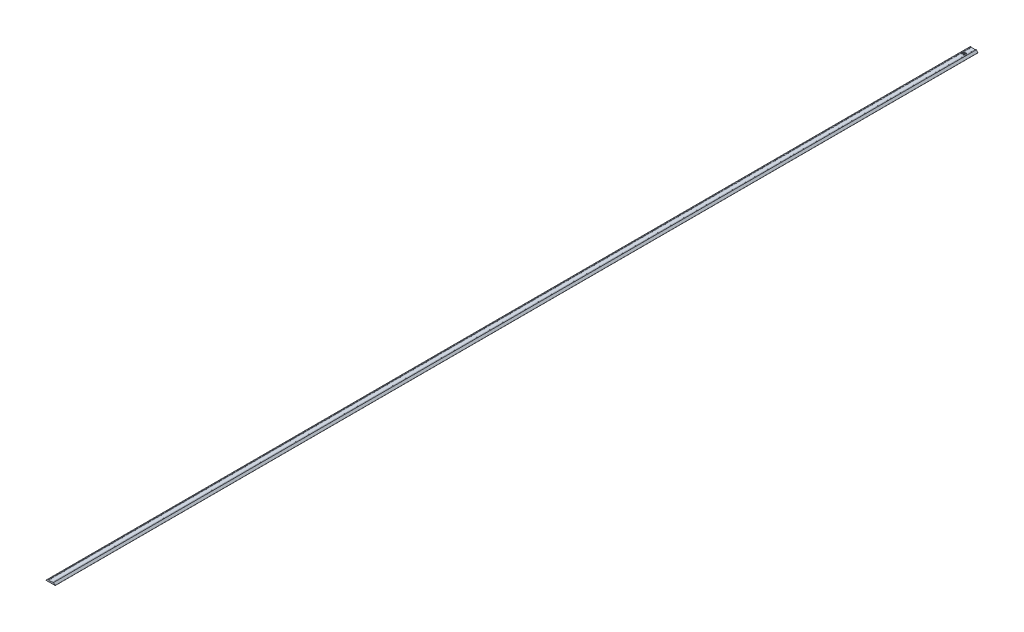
ISO-10303-21;
HEADER;
FILE_DESCRIPTION(('STEP AP214'),'2;1');
FILE_NAME('part.step','',(''),(''),'','','');
FILE_SCHEMA(('AUTOMOTIVE_DESIGN { 1 0 10303 214 1 1 1 1 }'));
ENDSEC;
DATA;
#1=APPLICATION_CONTEXT('core data for automotive mechanical design processes');
#2=APPLICATION_PROTOCOL_DEFINITION('international standard','automotive_design',2000,#1);
#3=PRODUCT_CONTEXT('',#1,'mechanical');
#4=PRODUCT('Part','Part','',(#3));
#5=PRODUCT_RELATED_PRODUCT_CATEGORY('part','',(#4));
#6=PRODUCT_DEFINITION_FORMATION('','',#4);
#7=PRODUCT_DEFINITION_CONTEXT('part definition',#1,'design');
#8=PRODUCT_DEFINITION('design','',#6,#7);
#9=PRODUCT_DEFINITION_SHAPE('','',#8);
#10=(LENGTH_UNIT() NAMED_UNIT(*) SI_UNIT(.MILLI.,.METRE.));
#11=(NAMED_UNIT(*) PLANE_ANGLE_UNIT() SI_UNIT($,.RADIAN.));
#12=(NAMED_UNIT(*) SI_UNIT($,.STERADIAN.) SOLID_ANGLE_UNIT());
#13=UNCERTAINTY_MEASURE_WITH_UNIT(LENGTH_MEASURE(1.E-05),#10,'distance_accuracy_value','');
#14=(GEOMETRIC_REPRESENTATION_CONTEXT(3) GLOBAL_UNCERTAINTY_ASSIGNED_CONTEXT((#13)) GLOBAL_UNIT_ASSIGNED_CONTEXT((#10,
#11,#12)) REPRESENTATION_CONTEXT('',''));
#15=CARTESIAN_POINT('',(0.,0.,0.));
#16=DIRECTION('',(0.,0.,1.));
#17=DIRECTION('',(1.,0.,0.));
#18=AXIS2_PLACEMENT_3D('',#15,#16,#17);
#19=CARTESIAN_POINT('',(3.,0.0499999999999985,2000.));
#20=DIRECTION('',(-1.,0.,0.));
#21=DIRECTION('',(0.,-1.,0.));
#22=AXIS2_PLACEMENT_3D('',#19,#20,#21);
#23=PLANE('',#22);
#24=DIRECTION('',(0.,1.,0.));
#25=VECTOR('',#24,1.);
#26=CARTESIAN_POINT('',(3.,0.0499999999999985,0.));
#27=LINE('',#26,#25);
#28=CARTESIAN_POINT('',(3.,0.,0.));
#29=VERTEX_POINT('',#28);
#30=CARTESIAN_POINT('',(3.,0.0499999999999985,0.));
#31=VERTEX_POINT('',#30);
#32=EDGE_CURVE('E300',#29,#31,#27,.T.);
#33=ORIENTED_EDGE('',*,*,#32,.T.);
#34=DIRECTION('',(0.,0.,-1.));
#35=VECTOR('',#34,1.);
#36=CARTESIAN_POINT('',(3.,0.0499999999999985,2000.));
#37=LINE('',#36,#35);
#38=CARTESIAN_POINT('',(3.,0.0499999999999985,2000.));
#39=VERTEX_POINT('',#38);
#40=EDGE_CURVE('E11',#39,#31,#37,.T.);
#41=ORIENTED_EDGE('',*,*,#40,.F.);
#42=DIRECTION('',(0.,1.,0.));
#43=VECTOR('',#42,1.);
#44=CARTESIAN_POINT('',(3.,0.0499999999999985,2000.));
#45=LINE('',#44,#43);
#46=CARTESIAN_POINT('',(3.,0.,2000.));
#47=VERTEX_POINT('',#46);
#48=EDGE_CURVE('E371',#47,#39,#45,.T.);
#49=ORIENTED_EDGE('',*,*,#48,.F.);
#50=DIRECTION('',(0.,0.,-1.));
#51=VECTOR('',#50,1.);
#52=CARTESIAN_POINT('',(3.,0.,2000.));
#53=LINE('',#52,#51);
#54=EDGE_CURVE('E296',#47,#29,#53,.T.);
#55=ORIENTED_EDGE('',*,*,#54,.T.);
#56=EDGE_LOOP('',(#33,#41,#49,#55));
#57=FACE_BOUND('',#56,.T.);
#58=ADVANCED_FACE('F35',(#57),#23,.F.);
#59=CARTESIAN_POINT('',(17.,0.0500000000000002,2000.));
#60=DIRECTION('',(0.,1.,0.));
#61=DIRECTION('',(-1.,0.,0.));
#62=AXIS2_PLACEMENT_3D('',#59,#60,#61);
#63=PLANE('',#62);
#64=CARTESIAN_POINT('',(10.,0.0499999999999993,20.));
#65=DIRECTION('',(0.,1.,0.));
#66=DIRECTION('',(-1.,0.,0.));
#67=AXIS2_PLACEMENT_3D('',#64,#65,#66);
#68=CIRCLE('',#67,1.7);
#69=CARTESIAN_POINT('',(8.30000000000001,0.0499999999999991,20.));
#70=VERTEX_POINT('',#69);
#71=EDGE_CURVE('E38',#70,#70,#68,.T.);
#72=ORIENTED_EDGE('',*,*,#71,.T.);
#73=EDGE_LOOP('',(#72));
#74=FACE_BOUND('',#73,.T.);
#75=DIRECTION('',(1.,0.,0.));
#76=VECTOR('',#75,1.);
#77=CARTESIAN_POINT('',(17.,0.0500000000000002,0.));
#78=LINE('',#77,#76);
#79=CARTESIAN_POINT('',(17.,0.0500000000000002,0.));
#80=VERTEX_POINT('',#79);
#81=EDGE_CURVE('E303',#31,#80,#78,.T.);
#82=ORIENTED_EDGE('',*,*,#81,.T.);
#83=DIRECTION('',(0.,0.,-1.));
#84=VECTOR('',#83,1.);
#85=CARTESIAN_POINT('',(17.,0.0500000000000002,2000.));
#86=LINE('',#85,#84);
#87=CARTESIAN_POINT('',(17.,0.0500000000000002,2000.));
#88=VERTEX_POINT('',#87);
#89=EDGE_CURVE('E44',#88,#80,#86,.T.);
#90=ORIENTED_EDGE('',*,*,#89,.F.);
#91=DIRECTION('',(1.,0.,0.));
#92=VECTOR('',#91,1.);
#93=CARTESIAN_POINT('',(17.,0.0500000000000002,2000.));
#94=LINE('',#93,#92);
#95=EDGE_CURVE('E179',#39,#88,#94,.T.);
#96=ORIENTED_EDGE('',*,*,#95,.F.);
#97=ORIENTED_EDGE('',*,*,#40,.T.);
#98=EDGE_LOOP('',(#82,#90,#96,#97));
#99=FACE_BOUND('',#98,.T.);
#100=ADVANCED_FACE('F570',(#74,#99),#63,.F.);
#101=CARTESIAN_POINT('',(17.,0.,2000.));
#102=DIRECTION('',(1.,0.,0.));
#103=DIRECTION('',(0.,0.,-1.));
#104=AXIS2_PLACEMENT_3D('',#101,#102,#103);
#105=PLANE('',#104);
#106=DIRECTION('',(0.,-1.,0.));
#107=VECTOR('',#106,1.);
#108=CARTESIAN_POINT('',(17.,0.,0.));
#109=LINE('',#108,#107);
#110=CARTESIAN_POINT('',(17.,0.,0.));
#111=VERTEX_POINT('',#110);
#112=EDGE_CURVE('E305',#80,#111,#109,.T.);
#113=ORIENTED_EDGE('',*,*,#112,.T.);
#114=DIRECTION('',(0.,0.,-1.));
#115=VECTOR('',#114,1.);
#116=CARTESIAN_POINT('',(17.,0.,2000.));
#117=LINE('',#116,#115);
#118=CARTESIAN_POINT('',(17.,0.,2000.));
#119=VERTEX_POINT('',#118);
#120=EDGE_CURVE('E462',#119,#111,#117,.T.);
#121=ORIENTED_EDGE('',*,*,#120,.F.);
#122=DIRECTION('',(0.,-1.,0.));
#123=VECTOR('',#122,1.);
#124=CARTESIAN_POINT('',(17.,0.,2000.));
#125=LINE('',#124,#123);
#126=EDGE_CURVE('E471',#88,#119,#125,.T.);
#127=ORIENTED_EDGE('',*,*,#126,.F.);
#128=ORIENTED_EDGE('',*,*,#89,.T.);
#129=EDGE_LOOP('',(#113,#121,#127,#128));
#130=FACE_BOUND('',#129,.T.);
#131=ADVANCED_FACE('F469',(#130),#105,.F.);
#132=CARTESIAN_POINT('',(19.9,0.,2000.));
#133=DIRECTION('',(0.,1.,0.));
#134=DIRECTION('',(-1.,0.,0.));
#135=AXIS2_PLACEMENT_3D('',#132,#133,#134);
#136=PLANE('',#135);
#137=DIRECTION('',(1.,0.,0.));
#138=VECTOR('',#137,1.);
#139=CARTESIAN_POINT('',(19.9,0.,0.));
#140=LINE('',#139,#138);
#141=CARTESIAN_POINT('',(19.9,0.,0.));
#142=VERTEX_POINT('',#141);
#143=EDGE_CURVE('E307',#111,#142,#140,.T.);
#144=ORIENTED_EDGE('',*,*,#143,.T.);
#145=DIRECTION('',(0.,0.,-1.));
#146=VECTOR('',#145,1.);
#147=CARTESIAN_POINT('',(19.9,0.,2000.));
#148=LINE('',#147,#146);
#149=CARTESIAN_POINT('',(19.9,0.,2000.));
#150=VERTEX_POINT('',#149);
#151=EDGE_CURVE('E459',#150,#142,#148,.T.);
#152=ORIENTED_EDGE('',*,*,#151,.F.);
#153=DIRECTION('',(1.,0.,0.));
#154=VECTOR('',#153,1.);
#155=CARTESIAN_POINT('',(19.9,0.,2000.));
#156=LINE('',#155,#154);
#157=EDGE_CURVE('E489',#119,#150,#156,.T.);
#158=ORIENTED_EDGE('',*,*,#157,.F.);
#159=ORIENTED_EDGE('',*,*,#120,.T.);
#160=EDGE_LOOP('',(#144,#152,#158,#159));
#161=FACE_BOUND('',#160,.T.);
#162=ADVANCED_FACE('F480',(#161),#136,.F.);
#163=CARTESIAN_POINT('',(19.9,0.1,2000.));
#164=DIRECTION('',(0.,0.,-1.));
#165=DIRECTION('',(-1.,0.,0.));
#166=AXIS2_PLACEMENT_3D('',#163,#164,#165);
#167=CYLINDRICAL_SURFACE('',#166,0.0999999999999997);
#168=CARTESIAN_POINT('',(19.9,0.1,0.));
#169=DIRECTION('',(0.,0.,1.));
#170=DIRECTION('',(-1.,0.,0.));
#171=AXIS2_PLACEMENT_3D('',#168,#169,#170);
#172=CIRCLE('',#171,0.0999999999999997);
#173=CARTESIAN_POINT('',(20.,0.1,0.));
#174=VERTEX_POINT('',#173);
#175=EDGE_CURVE('E309',#142,#174,#172,.T.);
#176=ORIENTED_EDGE('',*,*,#175,.T.);
#177=DIRECTION('',(0.,0.,-1.));
#178=VECTOR('',#177,1.);
#179=CARTESIAN_POINT('',(20.,0.1,2000.));
#180=LINE('',#179,#178);
#181=CARTESIAN_POINT('',(20.,0.1,2000.));
#182=VERTEX_POINT('',#181);
#183=EDGE_CURVE('E456',#182,#174,#180,.T.);
#184=ORIENTED_EDGE('',*,*,#183,.F.);
#185=CARTESIAN_POINT('',(19.9,0.1,2000.));
#186=DIRECTION('',(0.,0.,1.));
#187=DIRECTION('',(-1.,0.,0.));
#188=AXIS2_PLACEMENT_3D('',#185,#186,#187);
#189=CIRCLE('',#188,0.0999999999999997);
#190=EDGE_CURVE('E486',#150,#182,#189,.T.);
#191=ORIENTED_EDGE('',*,*,#190,.F.);
#192=ORIENTED_EDGE('',*,*,#151,.T.);
#193=EDGE_LOOP('',(#176,#184,#191,#192));
#194=FACE_BOUND('',#193,.T.);
#195=ADVANCED_FACE('F484',(#194),#167,.T.);
#196=CARTESIAN_POINT('',(20.,0.25857864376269,2000.));
#197=DIRECTION('',(-1.,0.,0.));
#198=DIRECTION('',(0.,0.,1.));
#199=AXIS2_PLACEMENT_3D('',#196,#197,#198);
#200=PLANE('',#199);
#201=DIRECTION('',(0.,1.,0.));
#202=VECTOR('',#201,1.);
#203=CARTESIAN_POINT('',(20.,0.25857864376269,0.));
#204=LINE('',#203,#202);
#205=CARTESIAN_POINT('',(20.,0.25857864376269,0.));
#206=VERTEX_POINT('',#205);
#207=EDGE_CURVE('E311',#174,#206,#204,.T.);
#208=ORIENTED_EDGE('',*,*,#207,.T.);
#209=DIRECTION('',(0.,0.,-1.));
#210=VECTOR('',#209,1.);
#211=CARTESIAN_POINT('',(20.,0.25857864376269,2000.));
#212=LINE('',#211,#210);
#213=CARTESIAN_POINT('',(20.,0.25857864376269,2000.));
#214=VERTEX_POINT('',#213);
#215=EDGE_CURVE('E453',#214,#206,#212,.T.);
#216=ORIENTED_EDGE('',*,*,#215,.F.);
#217=DIRECTION('',(0.,1.,0.));
#218=VECTOR('',#217,1.);
#219=CARTESIAN_POINT('',(20.,0.25857864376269,2000.));
#220=LINE('',#219,#218);
#221=EDGE_CURVE('E488',#182,#214,#220,.T.);
#222=ORIENTED_EDGE('',*,*,#221,.F.);
#223=ORIENTED_EDGE('',*,*,#183,.T.);
#224=EDGE_LOOP('',(#208,#216,#222,#223));
#225=FACE_BOUND('',#224,.T.);
#226=ADVANCED_FACE('F585',(#225),#200,.F.);
#227=CARTESIAN_POINT('',(19.9,0.258578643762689,2000.));
#228=DIRECTION('',(0.,0.,-1.));
#229=DIRECTION('',(-1.,0.,0.));
#230=AXIS2_PLACEMENT_3D('',#227,#228,#229);
#231=CYLINDRICAL_SURFACE('',#230,0.0999999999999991);
#232=CARTESIAN_POINT('',(19.9,0.258578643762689,0.));
#233=DIRECTION('',(0.,0.,1.));
#234=DIRECTION('',(-1.,0.,0.));
#235=AXIS2_PLACEMENT_3D('',#232,#233,#234);
#236=CIRCLE('',#235,0.0999999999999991);
#237=CARTESIAN_POINT('',(19.9707106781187,0.329289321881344,0.));
#238=VERTEX_POINT('',#237);
#239=EDGE_CURVE('E313',#206,#238,#236,.T.);
#240=ORIENTED_EDGE('',*,*,#239,.T.);
#241=DIRECTION('',(0.,0.,-1.));
#242=VECTOR('',#241,1.);
#243=CARTESIAN_POINT('',(19.9707106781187,0.329289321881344,2000.));
#244=LINE('',#243,#242);
#245=CARTESIAN_POINT('',(19.9707106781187,0.329289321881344,2000.));
#246=VERTEX_POINT('',#245);
#247=EDGE_CURVE('E450',#246,#238,#244,.T.);
#248=ORIENTED_EDGE('',*,*,#247,.F.);
#249=CARTESIAN_POINT('',(19.9,0.258578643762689,2000.));
#250=DIRECTION('',(0.,0.,1.));
#251=DIRECTION('',(-1.,0.,0.));
#252=AXIS2_PLACEMENT_3D('',#249,#250,#251);
#253=CIRCLE('',#252,0.0999999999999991);
#254=EDGE_CURVE('E491',#214,#246,#253,.T.);
#255=ORIENTED_EDGE('',*,*,#254,.F.);
#256=ORIENTED_EDGE('',*,*,#215,.T.);
#257=EDGE_LOOP('',(#240,#248,#255,#256));
#258=FACE_BOUND('',#257,.T.);
#259=ADVANCED_FACE('F588',(#258),#231,.T.);
#260=CARTESIAN_POINT('',(16.3292893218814,3.97071067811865,2000.));
#261=DIRECTION('',(-0.707106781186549,-0.707106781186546,0.));
#262=DIRECTION('',(0.707106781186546,-0.707106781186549,0.));
#263=AXIS2_PLACEMENT_3D('',#260,#261,#262);
#264=PLANE('',#263);
#265=DIRECTION('',(-0.707106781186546,0.707106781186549,0.));
#266=VECTOR('',#265,1.);
#267=CARTESIAN_POINT('',(16.3292893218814,3.97071067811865,0.));
#268=LINE('',#267,#266);
#269=CARTESIAN_POINT('',(16.3292893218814,3.97071067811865,0.));
#270=VERTEX_POINT('',#269);
#271=EDGE_CURVE('E315',#238,#270,#268,.T.);
#272=ORIENTED_EDGE('',*,*,#271,.T.);
#273=DIRECTION('',(0.,0.,-1.));
#274=VECTOR('',#273,1.);
#275=CARTESIAN_POINT('',(16.3292893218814,3.97071067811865,2000.));
#276=LINE('',#275,#274);
#277=CARTESIAN_POINT('',(16.3292893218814,3.97071067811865,2000.));
#278=VERTEX_POINT('',#277);
#279=EDGE_CURVE('E447',#278,#270,#276,.T.);
#280=ORIENTED_EDGE('',*,*,#279,.F.);
#281=DIRECTION('',(-0.707106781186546,0.707106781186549,0.));
#282=VECTOR('',#281,1.);
#283=CARTESIAN_POINT('',(16.3292893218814,3.97071067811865,2000.));
#284=LINE('',#283,#282);
#285=EDGE_CURVE('E497',#246,#278,#284,.T.);
#286=ORIENTED_EDGE('',*,*,#285,.F.);
#287=ORIENTED_EDGE('',*,*,#247,.T.);
#288=EDGE_LOOP('',(#272,#280,#286,#287));
#289=FACE_BOUND('',#288,.T.);
#290=ADVANCED_FACE('F592',(#289),#264,.F.);
#291=CARTESIAN_POINT('',(16.2585786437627,3.9,2000.));
#292=DIRECTION('',(0.,0.,-1.));
#293=DIRECTION('',(-1.,0.,0.));
#294=AXIS2_PLACEMENT_3D('',#291,#292,#293);
#295=CYLINDRICAL_SURFACE('',#294,0.100000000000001);
#296=CARTESIAN_POINT('',(16.2585786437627,3.9,0.));
#297=DIRECTION('',(0.,0.,1.));
#298=DIRECTION('',(1.,0.,0.));
#299=AXIS2_PLACEMENT_3D('',#296,#297,#298);
#300=CIRCLE('',#299,0.100000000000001);
#301=CARTESIAN_POINT('',(16.2585786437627,4.,0.));
#302=VERTEX_POINT('',#301);
#303=EDGE_CURVE('E317',#270,#302,#300,.T.);
#304=ORIENTED_EDGE('',*,*,#303,.T.);
#305=DIRECTION('',(0.,0.,-1.));
#306=VECTOR('',#305,1.);
#307=CARTESIAN_POINT('',(16.2585786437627,4.,2000.));
#308=LINE('',#307,#306);
#309=CARTESIAN_POINT('',(16.2585786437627,4.,2000.));
#310=VERTEX_POINT('',#309);
#311=EDGE_CURVE('E444',#310,#302,#308,.T.);
#312=ORIENTED_EDGE('',*,*,#311,.F.);
#313=CARTESIAN_POINT('',(16.2585786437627,3.9,2000.));
#314=DIRECTION('',(0.,0.,1.));
#315=DIRECTION('',(1.,0.,0.));
#316=AXIS2_PLACEMENT_3D('',#313,#314,#315);
#317=CIRCLE('',#316,0.100000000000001);
#318=EDGE_CURVE('E499',#278,#310,#317,.T.);
#319=ORIENTED_EDGE('',*,*,#318,.F.);
#320=ORIENTED_EDGE('',*,*,#279,.T.);
#321=EDGE_LOOP('',(#304,#312,#319,#320));
#322=FACE_BOUND('',#321,.T.);
#323=ADVANCED_FACE('F596',(#322),#295,.T.);
#324=CARTESIAN_POINT('',(14.65,4.,2000.));
#325=DIRECTION('',(0.,-1.,0.));
#326=DIRECTION('',(1.,0.,0.));
#327=AXIS2_PLACEMENT_3D('',#324,#325,#326);
#328=PLANE('',#327);
#329=DIRECTION('',(-1.,0.,0.));
#330=VECTOR('',#329,1.);
#331=CARTESIAN_POINT('',(14.65,4.,0.));
#332=LINE('',#331,#330);
#333=CARTESIAN_POINT('',(14.65,4.,0.));
#334=VERTEX_POINT('',#333);
#335=EDGE_CURVE('E319',#302,#334,#332,.T.);
#336=ORIENTED_EDGE('',*,*,#335,.T.);
#337=DIRECTION('',(0.,0.,-1.));
#338=VECTOR('',#337,1.);
#339=CARTESIAN_POINT('',(14.65,4.,2000.));
#340=LINE('',#339,#338);
#341=CARTESIAN_POINT('',(14.65,4.,2000.));
#342=VERTEX_POINT('',#341);
#343=EDGE_CURVE('E441',#342,#334,#340,.T.);
#344=ORIENTED_EDGE('',*,*,#343,.F.);
#345=DIRECTION('',(-1.,0.,0.));
#346=VECTOR('',#345,1.);
#347=CARTESIAN_POINT('',(14.65,4.,2000.));
#348=LINE('',#347,#346);
#349=EDGE_CURVE('E501',#310,#342,#348,.T.);
#350=ORIENTED_EDGE('',*,*,#349,.F.);
#351=ORIENTED_EDGE('',*,*,#311,.T.);
#352=EDGE_LOOP('',(#336,#344,#350,#351));
#353=FACE_BOUND('',#352,.T.);
#354=ADVANCED_FACE('F600',(#353),#328,.F.);
#355=CARTESIAN_POINT('',(14.65,3.85,2000.));
#356=DIRECTION('',(0.,0.,-1.));
#357=DIRECTION('',(-1.,0.,0.));
#358=AXIS2_PLACEMENT_3D('',#355,#356,#357);
#359=CYLINDRICAL_SURFACE('',#358,0.150000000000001);
#360=CARTESIAN_POINT('',(14.65,3.85,0.));
#361=DIRECTION('',(0.,0.,1.));
#362=DIRECTION('',(1.,0.,0.));
#363=AXIS2_PLACEMENT_3D('',#360,#361,#362);
#364=CIRCLE('',#363,0.150000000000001);
#365=CARTESIAN_POINT('',(14.5,3.85,0.));
#366=VERTEX_POINT('',#365);
#367=EDGE_CURVE('E321',#334,#366,#364,.T.);
#368=ORIENTED_EDGE('',*,*,#367,.T.);
#369=DIRECTION('',(0.,0.,-1.));
#370=VECTOR('',#369,1.);
#371=CARTESIAN_POINT('',(14.5,3.85,2000.));
#372=LINE('',#371,#370);
#373=CARTESIAN_POINT('',(14.5,3.85,2000.));
#374=VERTEX_POINT('',#373);
#375=EDGE_CURVE('E438',#374,#366,#372,.T.);
#376=ORIENTED_EDGE('',*,*,#375,.F.);
#377=CARTESIAN_POINT('',(14.65,3.85,2000.));
#378=DIRECTION('',(0.,0.,1.));
#379=DIRECTION('',(1.,0.,0.));
#380=AXIS2_PLACEMENT_3D('',#377,#378,#379);
#381=CIRCLE('',#380,0.150000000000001);
#382=EDGE_CURVE('E503',#342,#374,#381,.T.);
#383=ORIENTED_EDGE('',*,*,#382,.F.);
#384=ORIENTED_EDGE('',*,*,#343,.T.);
#385=EDGE_LOOP('',(#368,#376,#383,#384));
#386=FACE_BOUND('',#385,.T.);
#387=ADVANCED_FACE('F604',(#386),#359,.T.);
#388=CARTESIAN_POINT('',(14.5,3.75,2000.));
#389=DIRECTION('',(1.,0.,0.));
#390=DIRECTION('',(0.,0.,-1.));
#391=AXIS2_PLACEMENT_3D('',#388,#389,#390);
#392=PLANE('',#391);
#393=DIRECTION('',(0.,-1.,0.));
#394=VECTOR('',#393,1.);
#395=CARTESIAN_POINT('',(14.5,3.75,0.));
#396=LINE('',#395,#394);
#397=CARTESIAN_POINT('',(14.5,3.75,0.));
#398=VERTEX_POINT('',#397);
#399=EDGE_CURVE('E323',#366,#398,#396,.T.);
#400=ORIENTED_EDGE('',*,*,#399,.T.);
#401=DIRECTION('',(0.,0.,-1.));
#402=VECTOR('',#401,1.);
#403=CARTESIAN_POINT('',(14.5,3.75,2000.));
#404=LINE('',#403,#402);
#405=CARTESIAN_POINT('',(14.5,3.75,2000.));
#406=VERTEX_POINT('',#405);
#407=EDGE_CURVE('E435',#406,#398,#404,.T.);
#408=ORIENTED_EDGE('',*,*,#407,.F.);
#409=DIRECTION('',(0.,-1.,0.));
#410=VECTOR('',#409,1.);
#411=CARTESIAN_POINT('',(14.5,3.75,2000.));
#412=LINE('',#411,#410);
#413=EDGE_CURVE('E505',#374,#406,#412,.T.);
#414=ORIENTED_EDGE('',*,*,#413,.F.);
#415=ORIENTED_EDGE('',*,*,#375,.T.);
#416=EDGE_LOOP('',(#400,#408,#414,#415));
#417=FACE_BOUND('',#416,.T.);
#418=ADVANCED_FACE('F608',(#417),#392,.F.);
#419=CARTESIAN_POINT('',(14.65,3.75,2000.));
#420=DIRECTION('',(0.,0.,-1.));
#421=DIRECTION('',(-1.,0.,0.));
#422=AXIS2_PLACEMENT_3D('',#419,#420,#421);
#423=CYLINDRICAL_SURFACE('',#422,0.15);
#424=CARTESIAN_POINT('',(14.65,3.75,0.));
#425=DIRECTION('',(0.,0.,1.));
#426=DIRECTION('',(1.,0.,0.));
#427=AXIS2_PLACEMENT_3D('',#424,#425,#426);
#428=CIRCLE('',#427,0.15);
#429=CARTESIAN_POINT('',(14.65,3.6,0.));
#430=VERTEX_POINT('',#429);
#431=EDGE_CURVE('E325',#398,#430,#428,.T.);
#432=ORIENTED_EDGE('',*,*,#431,.T.);
#433=DIRECTION('',(0.,0.,-1.));
#434=VECTOR('',#433,1.);
#435=CARTESIAN_POINT('',(14.65,3.6,2000.));
#436=LINE('',#435,#434);
#437=CARTESIAN_POINT('',(14.65,3.6,2000.));
#438=VERTEX_POINT('',#437);
#439=EDGE_CURVE('E432',#438,#430,#436,.T.);
#440=ORIENTED_EDGE('',*,*,#439,.F.);
#441=CARTESIAN_POINT('',(14.65,3.75,2000.));
#442=DIRECTION('',(0.,0.,1.));
#443=DIRECTION('',(1.,0.,0.));
#444=AXIS2_PLACEMENT_3D('',#441,#442,#443);
#445=CIRCLE('',#444,0.15);
#446=EDGE_CURVE('E507',#406,#438,#445,.T.);
#447=ORIENTED_EDGE('',*,*,#446,.F.);
#448=ORIENTED_EDGE('',*,*,#407,.T.);
#449=EDGE_LOOP('',(#432,#440,#447,#448));
#450=FACE_BOUND('',#449,.T.);
#451=ADVANCED_FACE('F612',(#450),#423,.T.);
#452=CARTESIAN_POINT('',(14.975,3.6,2000.));
#453=DIRECTION('',(0.,1.,0.));
#454=DIRECTION('',(0.,0.,1.));
#455=AXIS2_PLACEMENT_3D('',#452,#453,#454);
#456=PLANE('',#455);
#457=DIRECTION('',(1.,0.,0.));
#458=VECTOR('',#457,1.);
#459=CARTESIAN_POINT('',(14.975,3.6,0.));
#460=LINE('',#459,#458);
#461=CARTESIAN_POINT('',(14.975,3.6,0.));
#462=VERTEX_POINT('',#461);
#463=EDGE_CURVE('E327',#430,#462,#460,.T.);
#464=ORIENTED_EDGE('',*,*,#463,.T.);
#465=DIRECTION('',(0.,0.,-1.));
#466=VECTOR('',#465,1.);
#467=CARTESIAN_POINT('',(14.975,3.6,2000.));
#468=LINE('',#467,#466);
#469=CARTESIAN_POINT('',(14.975,3.6,2000.));
#470=VERTEX_POINT('',#469);
#471=EDGE_CURVE('E429',#470,#462,#468,.T.);
#472=ORIENTED_EDGE('',*,*,#471,.F.);
#473=DIRECTION('',(1.,0.,0.));
#474=VECTOR('',#473,1.);
#475=CARTESIAN_POINT('',(14.975,3.6,2000.));
#476=LINE('',#475,#474);
#477=EDGE_CURVE('E509',#438,#470,#476,.T.);
#478=ORIENTED_EDGE('',*,*,#477,.F.);
#479=ORIENTED_EDGE('',*,*,#439,.T.);
#480=EDGE_LOOP('',(#464,#472,#478,#479));
#481=FACE_BOUND('',#480,.T.);
#482=ADVANCED_FACE('F616',(#481),#456,.F.);
#483=CARTESIAN_POINT('',(14.975,3.45,2000.));
#484=DIRECTION('',(0.,0.,-1.));
#485=DIRECTION('',(-1.,0.,0.));
#486=AXIS2_PLACEMENT_3D('',#483,#484,#485);
#487=CYLINDRICAL_SURFACE('',#486,0.15);
#488=CARTESIAN_POINT('',(14.975,3.45,0.));
#489=DIRECTION('',(0.,0.,-1.));
#490=DIRECTION('',(-1.,0.,0.));
#491=AXIS2_PLACEMENT_3D('',#488,#489,#490);
#492=CIRCLE('',#491,0.15);
#493=CARTESIAN_POINT('',(15.125,3.45,0.));
#494=VERTEX_POINT('',#493);
#495=EDGE_CURVE('E329',#462,#494,#492,.T.);
#496=ORIENTED_EDGE('',*,*,#495,.T.);
#497=DIRECTION('',(0.,0.,-1.));
#498=VECTOR('',#497,1.);
#499=CARTESIAN_POINT('',(15.125,3.45,2000.));
#500=LINE('',#499,#498);
#501=CARTESIAN_POINT('',(15.125,3.45,2000.));
#502=VERTEX_POINT('',#501);
#503=EDGE_CURVE('E426',#502,#494,#500,.T.);
#504=ORIENTED_EDGE('',*,*,#503,.F.);
#505=CARTESIAN_POINT('',(14.975,3.45,2000.));
#506=DIRECTION('',(0.,0.,-1.));
#507=DIRECTION('',(-1.,0.,0.));
#508=AXIS2_PLACEMENT_3D('',#505,#506,#507);
#509=CIRCLE('',#508,0.15);
#510=EDGE_CURVE('E511',#470,#502,#509,.T.);
#511=ORIENTED_EDGE('',*,*,#510,.F.);
#512=ORIENTED_EDGE('',*,*,#471,.T.);
#513=EDGE_LOOP('',(#496,#504,#511,#512));
#514=FACE_BOUND('',#513,.T.);
#515=ADVANCED_FACE('F620',(#514),#487,.F.);
#516=CARTESIAN_POINT('',(15.125,3.4,2000.));
#517=DIRECTION('',(1.,0.,0.));
#518=DIRECTION('',(0.,0.,-1.));
#519=AXIS2_PLACEMENT_3D('',#516,#517,#518);
#520=PLANE('',#519);
#521=DIRECTION('',(0.,-1.,0.));
#522=VECTOR('',#521,1.);
#523=CARTESIAN_POINT('',(15.125,3.4,0.));
#524=LINE('',#523,#522);
#525=CARTESIAN_POINT('',(15.125,3.4,0.));
#526=VERTEX_POINT('',#525);
#527=EDGE_CURVE('E331',#494,#526,#524,.T.);
#528=ORIENTED_EDGE('',*,*,#527,.T.);
#529=DIRECTION('',(0.,0.,-1.));
#530=VECTOR('',#529,1.);
#531=CARTESIAN_POINT('',(15.125,3.4,2000.));
#532=LINE('',#531,#530);
#533=CARTESIAN_POINT('',(15.125,3.4,2000.));
#534=VERTEX_POINT('',#533);
#535=EDGE_CURVE('E423',#534,#526,#532,.T.);
#536=ORIENTED_EDGE('',*,*,#535,.F.);
#537=DIRECTION('',(0.,-1.,0.));
#538=VECTOR('',#537,1.);
#539=CARTESIAN_POINT('',(15.125,3.4,2000.));
#540=LINE('',#539,#538);
#541=EDGE_CURVE('E513',#502,#534,#540,.T.);
#542=ORIENTED_EDGE('',*,*,#541,.F.);
#543=ORIENTED_EDGE('',*,*,#503,.T.);
#544=EDGE_LOOP('',(#528,#536,#542,#543));
#545=FACE_BOUND('',#544,.T.);
#546=ADVANCED_FACE('F624',(#545),#520,.F.);
#547=CARTESIAN_POINT('',(14.975,3.4,2000.));
#548=DIRECTION('',(0.,0.,-1.));
#549=DIRECTION('',(-1.,0.,0.));
#550=AXIS2_PLACEMENT_3D('',#547,#548,#549);
#551=CYLINDRICAL_SURFACE('',#550,0.15);
#552=CARTESIAN_POINT('',(14.975,3.4,0.));
#553=DIRECTION('',(0.,0.,-1.));
#554=DIRECTION('',(-1.,0.,0.));
#555=AXIS2_PLACEMENT_3D('',#552,#553,#554);
#556=CIRCLE('',#555,0.15);
#557=CARTESIAN_POINT('',(14.975,3.25,0.));
#558=VERTEX_POINT('',#557);
#559=EDGE_CURVE('E333',#526,#558,#556,.T.);
#560=ORIENTED_EDGE('',*,*,#559,.T.);
#561=DIRECTION('',(0.,0.,-1.));
#562=VECTOR('',#561,1.);
#563=CARTESIAN_POINT('',(14.975,3.25,2000.));
#564=LINE('',#563,#562);
#565=CARTESIAN_POINT('',(14.975,3.25,2000.));
#566=VERTEX_POINT('',#565);
#567=EDGE_CURVE('E420',#566,#558,#564,.T.);
#568=ORIENTED_EDGE('',*,*,#567,.F.);
#569=CARTESIAN_POINT('',(14.975,3.4,2000.));
#570=DIRECTION('',(0.,0.,-1.));
#571=DIRECTION('',(-1.,0.,0.));
#572=AXIS2_PLACEMENT_3D('',#569,#570,#571);
#573=CIRCLE('',#572,0.15);
#574=EDGE_CURVE('E515',#534,#566,#573,.T.);
#575=ORIENTED_EDGE('',*,*,#574,.F.);
#576=ORIENTED_EDGE('',*,*,#535,.T.);
#577=EDGE_LOOP('',(#560,#568,#575,#576));
#578=FACE_BOUND('',#577,.T.);
#579=ADVANCED_FACE('F628',(#578),#551,.F.);
#580=CARTESIAN_POINT('',(14.,3.25,2000.));
#581=DIRECTION('',(0.,-1.,0.));
#582=DIRECTION('',(0.,0.,-1.));
#583=AXIS2_PLACEMENT_3D('',#580,#581,#582);
#584=PLANE('',#583);
#585=DIRECTION('',(-1.,0.,0.));
#586=VECTOR('',#585,1.);
#587=CARTESIAN_POINT('',(14.,3.25,0.));
#588=LINE('',#587,#586);
#589=CARTESIAN_POINT('',(14.,3.25,0.));
#590=VERTEX_POINT('',#589);
#591=EDGE_CURVE('E335',#558,#590,#588,.T.);
#592=ORIENTED_EDGE('',*,*,#591,.T.);
#593=DIRECTION('',(0.,0.,-1.));
#594=VECTOR('',#593,1.);
#595=CARTESIAN_POINT('',(14.,3.25,2000.));
#596=LINE('',#595,#594);
#597=CARTESIAN_POINT('',(14.,3.25,2000.));
#598=VERTEX_POINT('',#597);
#599=EDGE_CURVE('E417',#598,#590,#596,.T.);
#600=ORIENTED_EDGE('',*,*,#599,.F.);
#601=DIRECTION('',(-1.,0.,0.));
#602=VECTOR('',#601,1.);
#603=CARTESIAN_POINT('',(14.,3.25,2000.));
#604=LINE('',#603,#602);
#605=EDGE_CURVE('E517',#566,#598,#604,.T.);
#606=ORIENTED_EDGE('',*,*,#605,.F.);
#607=ORIENTED_EDGE('',*,*,#567,.T.);
#608=EDGE_LOOP('',(#592,#600,#606,#607));
#609=FACE_BOUND('',#608,.T.);
#610=ADVANCED_FACE('F632',(#609),#584,.F.);
#611=CARTESIAN_POINT('',(14.,3.25,2000.));
#612=DIRECTION('',(1.,0.,0.));
#613=DIRECTION('',(0.,0.,-1.));
#614=AXIS2_PLACEMENT_3D('',#611,#612,#613);
#615=PLANE('',#614);
#616=DIRECTION('',(0.,-1.,0.));
#617=VECTOR('',#616,1.);
#618=CARTESIAN_POINT('',(14.,3.25,0.));
#619=LINE('',#618,#617);
#620=CARTESIAN_POINT('',(14.,3.2,0.));
#621=VERTEX_POINT('',#620);
#622=EDGE_CURVE('E337',#590,#621,#619,.T.);
#623=ORIENTED_EDGE('',*,*,#622,.T.);
#624=DIRECTION('',(0.,0.,-1.));
#625=VECTOR('',#624,1.);
#626=CARTESIAN_POINT('',(14.,3.2,2000.));
#627=LINE('',#626,#625);
#628=CARTESIAN_POINT('',(14.,3.2,2000.));
#629=VERTEX_POINT('',#628);
#630=EDGE_CURVE('E414',#629,#621,#627,.T.);
#631=ORIENTED_EDGE('',*,*,#630,.F.);
#632=DIRECTION('',(0.,-1.,0.));
#633=VECTOR('',#632,1.);
#634=CARTESIAN_POINT('',(14.,3.25,2000.));
#635=LINE('',#634,#633);
#636=EDGE_CURVE('E519',#598,#629,#635,.T.);
#637=ORIENTED_EDGE('',*,*,#636,.F.);
#638=ORIENTED_EDGE('',*,*,#599,.T.);
#639=EDGE_LOOP('',(#623,#631,#637,#638));
#640=FACE_BOUND('',#639,.T.);
#641=ADVANCED_FACE('F636',(#640),#615,.F.);
#642=CARTESIAN_POINT('',(6.,3.2,2000.));
#643=DIRECTION('',(0.,-1.,0.));
#644=DIRECTION('',(0.,0.,-1.));
#645=AXIS2_PLACEMENT_3D('',#642,#643,#644);
#646=PLANE('',#645);
#647=CARTESIAN_POINT('',(10.,3.2,20.));
#648=DIRECTION('',(0.,1.,0.));
#649=DIRECTION('',(0.,0.,1.));
#650=AXIS2_PLACEMENT_3D('',#647,#648,#649);
#651=CIRCLE('',#650,3.75);
#652=CARTESIAN_POINT('',(10.,3.2,23.75));
#653=VERTEX_POINT('',#652);
#654=EDGE_CURVE('E773',#653,#653,#651,.T.);
#655=ORIENTED_EDGE('',*,*,#654,.F.);
#656=EDGE_LOOP('',(#655));
#657=FACE_BOUND('',#656,.T.);
#658=DIRECTION('',(-1.,0.,0.));
#659=VECTOR('',#658,1.);
#660=CARTESIAN_POINT('',(6.,3.2,0.));
#661=LINE('',#660,#659);
#662=CARTESIAN_POINT('',(6.,3.2,0.));
#663=VERTEX_POINT('',#662);
#664=EDGE_CURVE('E340',#621,#663,#661,.T.);
#665=ORIENTED_EDGE('',*,*,#664,.T.);
#666=DIRECTION('',(0.,0.,-1.));
#667=VECTOR('',#666,1.);
#668=CARTESIAN_POINT('',(6.,3.2,2000.));
#669=LINE('',#668,#667);
#670=CARTESIAN_POINT('',(6.,3.2,2000.));
#671=VERTEX_POINT('',#670);
#672=EDGE_CURVE('E411',#671,#663,#669,.T.);
#673=ORIENTED_EDGE('',*,*,#672,.F.);
#674=DIRECTION('',(-1.,0.,0.));
#675=VECTOR('',#674,1.);
#676=CARTESIAN_POINT('',(9.9,3.2,2000.));
#677=LINE('',#676,#675);
#678=EDGE_CURVE('E521',#629,#671,#677,.T.);
#679=ORIENTED_EDGE('',*,*,#678,.F.);
#680=ORIENTED_EDGE('',*,*,#630,.T.);
#681=EDGE_LOOP('',(#665,#673,#679,#680));
#682=FACE_BOUND('',#681,.T.);
#683=ADVANCED_FACE('F640',(#657,#682),#646,.F.);
#684=CARTESIAN_POINT('',(6.,3.25,2000.));
#685=DIRECTION('',(-1.,0.,0.));
#686=DIRECTION('',(0.,0.,1.));
#687=AXIS2_PLACEMENT_3D('',#684,#685,#686);
#688=PLANE('',#687);
#689=DIRECTION('',(0.,1.,0.));
#690=VECTOR('',#689,1.);
#691=CARTESIAN_POINT('',(6.,3.25,0.));
#692=LINE('',#691,#690);
#693=CARTESIAN_POINT('',(6.,3.25,0.));
#694=VERTEX_POINT('',#693);
#695=EDGE_CURVE('E342',#663,#694,#692,.T.);
#696=ORIENTED_EDGE('',*,*,#695,.T.);
#697=DIRECTION('',(0.,0.,-1.));
#698=VECTOR('',#697,1.);
#699=CARTESIAN_POINT('',(6.,3.25,2000.));
#700=LINE('',#699,#698);
#701=CARTESIAN_POINT('',(6.,3.25,2000.));
#702=VERTEX_POINT('',#701);
#703=EDGE_CURVE('E408',#702,#694,#700,.T.);
#704=ORIENTED_EDGE('',*,*,#703,.F.);
#705=DIRECTION('',(0.,1.,0.));
#706=VECTOR('',#705,1.);
#707=CARTESIAN_POINT('',(6.,3.25,2000.));
#708=LINE('',#707,#706);
#709=EDGE_CURVE('E523',#671,#702,#708,.T.);
#710=ORIENTED_EDGE('',*,*,#709,.F.);
#711=ORIENTED_EDGE('',*,*,#672,.T.);
#712=EDGE_LOOP('',(#696,#704,#710,#711));
#713=FACE_BOUND('',#712,.T.);
#714=ADVANCED_FACE('F644',(#713),#688,.F.);
#715=CARTESIAN_POINT('',(5.025,3.25,2000.));
#716=DIRECTION('',(0.,-1.,0.));
#717=DIRECTION('',(0.,0.,-1.));
#718=AXIS2_PLACEMENT_3D('',#715,#716,#717);
#719=PLANE('',#718);
#720=DIRECTION('',(-1.,0.,0.));
#721=VECTOR('',#720,1.);
#722=CARTESIAN_POINT('',(5.025,3.25,0.));
#723=LINE('',#722,#721);
#724=CARTESIAN_POINT('',(5.025,3.25,0.));
#725=VERTEX_POINT('',#724);
#726=EDGE_CURVE('E344',#694,#725,#723,.T.);
#727=ORIENTED_EDGE('',*,*,#726,.T.);
#728=DIRECTION('',(0.,0.,-1.));
#729=VECTOR('',#728,1.);
#730=CARTESIAN_POINT('',(5.025,3.25,2000.));
#731=LINE('',#730,#729);
#732=CARTESIAN_POINT('',(5.025,3.25,2000.));
#733=VERTEX_POINT('',#732);
#734=EDGE_CURVE('E405',#733,#725,#731,.T.);
#735=ORIENTED_EDGE('',*,*,#734,.F.);
#736=DIRECTION('',(-1.,0.,0.));
#737=VECTOR('',#736,1.);
#738=CARTESIAN_POINT('',(5.025,3.25,2000.));
#739=LINE('',#738,#737);
#740=EDGE_CURVE('E525',#702,#733,#739,.T.);
#741=ORIENTED_EDGE('',*,*,#740,.F.);
#742=ORIENTED_EDGE('',*,*,#703,.T.);
#743=EDGE_LOOP('',(#727,#735,#741,#742));
#744=FACE_BOUND('',#743,.T.);
#745=ADVANCED_FACE('F648',(#744),#719,.F.);
#746=CARTESIAN_POINT('',(5.025,3.4,2000.));
#747=DIRECTION('',(0.,0.,-1.));
#748=DIRECTION('',(-1.,0.,0.));
#749=AXIS2_PLACEMENT_3D('',#746,#747,#748);
#750=CYLINDRICAL_SURFACE('',#749,0.15);
#751=CARTESIAN_POINT('',(5.025,3.4,0.));
#752=DIRECTION('',(0.,0.,-1.));
#753=DIRECTION('',(-1.,0.,0.));
#754=AXIS2_PLACEMENT_3D('',#751,#752,#753);
#755=CIRCLE('',#754,0.15);
#756=CARTESIAN_POINT('',(4.875,3.4,0.));
#757=VERTEX_POINT('',#756);
#758=EDGE_CURVE('E346',#725,#757,#755,.T.);
#759=ORIENTED_EDGE('',*,*,#758,.T.);
#760=DIRECTION('',(0.,0.,-1.));
#761=VECTOR('',#760,1.);
#762=CARTESIAN_POINT('',(4.875,3.4,2000.));
#763=LINE('',#762,#761);
#764=CARTESIAN_POINT('',(4.875,3.4,2000.));
#765=VERTEX_POINT('',#764);
#766=EDGE_CURVE('E402',#765,#757,#763,.T.);
#767=ORIENTED_EDGE('',*,*,#766,.F.);
#768=CARTESIAN_POINT('',(5.025,3.4,2000.));
#769=DIRECTION('',(0.,0.,-1.));
#770=DIRECTION('',(-1.,0.,0.));
#771=AXIS2_PLACEMENT_3D('',#768,#769,#770);
#772=CIRCLE('',#771,0.15);
#773=EDGE_CURVE('E527',#733,#765,#772,.T.);
#774=ORIENTED_EDGE('',*,*,#773,.F.);
#775=ORIENTED_EDGE('',*,*,#734,.T.);
#776=EDGE_LOOP('',(#759,#767,#774,#775));
#777=FACE_BOUND('',#776,.T.);
#778=ADVANCED_FACE('F652',(#777),#750,.F.);
#779=CARTESIAN_POINT('',(4.875,3.45,2000.));
#780=DIRECTION('',(-1.,0.,0.));
#781=DIRECTION('',(0.,0.,1.));
#782=AXIS2_PLACEMENT_3D('',#779,#780,#781);
#783=PLANE('',#782);
#784=DIRECTION('',(0.,1.,0.));
#785=VECTOR('',#784,1.);
#786=CARTESIAN_POINT('',(4.875,3.45,0.));
#787=LINE('',#786,#785);
#788=CARTESIAN_POINT('',(4.875,3.45,0.));
#789=VERTEX_POINT('',#788);
#790=EDGE_CURVE('E348',#757,#789,#787,.T.);
#791=ORIENTED_EDGE('',*,*,#790,.T.);
#792=DIRECTION('',(0.,0.,-1.));
#793=VECTOR('',#792,1.);
#794=CARTESIAN_POINT('',(4.875,3.45,2000.));
#795=LINE('',#794,#793);
#796=CARTESIAN_POINT('',(4.875,3.45,2000.));
#797=VERTEX_POINT('',#796);
#798=EDGE_CURVE('E399',#797,#789,#795,.T.);
#799=ORIENTED_EDGE('',*,*,#798,.F.);
#800=DIRECTION('',(0.,1.,0.));
#801=VECTOR('',#800,1.);
#802=CARTESIAN_POINT('',(4.875,3.45,2000.));
#803=LINE('',#802,#801);
#804=EDGE_CURVE('E529',#765,#797,#803,.T.);
#805=ORIENTED_EDGE('',*,*,#804,.F.);
#806=ORIENTED_EDGE('',*,*,#766,.T.);
#807=EDGE_LOOP('',(#791,#799,#805,#806));
#808=FACE_BOUND('',#807,.T.);
#809=ADVANCED_FACE('F656',(#808),#783,.F.);
#810=CARTESIAN_POINT('',(5.025,3.45,2000.));
#811=DIRECTION('',(0.,0.,-1.));
#812=DIRECTION('',(-1.,0.,0.));
#813=AXIS2_PLACEMENT_3D('',#810,#811,#812);
#814=CYLINDRICAL_SURFACE('',#813,0.15);
#815=CARTESIAN_POINT('',(5.025,3.45,0.));
#816=DIRECTION('',(0.,0.,-1.));
#817=DIRECTION('',(1.,0.,0.));
#818=AXIS2_PLACEMENT_3D('',#815,#816,#817);
#819=CIRCLE('',#818,0.15);
#820=CARTESIAN_POINT('',(5.025,3.6,0.));
#821=VERTEX_POINT('',#820);
#822=EDGE_CURVE('E350',#789,#821,#819,.T.);
#823=ORIENTED_EDGE('',*,*,#822,.T.);
#824=DIRECTION('',(0.,0.,-1.));
#825=VECTOR('',#824,1.);
#826=CARTESIAN_POINT('',(5.025,3.6,2000.));
#827=LINE('',#826,#825);
#828=CARTESIAN_POINT('',(5.025,3.6,2000.));
#829=VERTEX_POINT('',#828);
#830=EDGE_CURVE('E396',#829,#821,#827,.T.);
#831=ORIENTED_EDGE('',*,*,#830,.F.);
#832=CARTESIAN_POINT('',(5.025,3.45,2000.));
#833=DIRECTION('',(0.,0.,-1.));
#834=DIRECTION('',(1.,0.,0.));
#835=AXIS2_PLACEMENT_3D('',#832,#833,#834);
#836=CIRCLE('',#835,0.15);
#837=EDGE_CURVE('E531',#797,#829,#836,.T.);
#838=ORIENTED_EDGE('',*,*,#837,.F.);
#839=ORIENTED_EDGE('',*,*,#798,.T.);
#840=EDGE_LOOP('',(#823,#831,#838,#839));
#841=FACE_BOUND('',#840,.T.);
#842=ADVANCED_FACE('F660',(#841),#814,.F.);
#843=CARTESIAN_POINT('',(5.35,3.6,2000.));
#844=DIRECTION('',(0.,1.,0.));
#845=DIRECTION('',(0.,0.,1.));
#846=AXIS2_PLACEMENT_3D('',#843,#844,#845);
#847=PLANE('',#846);
#848=DIRECTION('',(1.,0.,0.));
#849=VECTOR('',#848,1.);
#850=CARTESIAN_POINT('',(5.35,3.6,0.));
#851=LINE('',#850,#849);
#852=CARTESIAN_POINT('',(5.35,3.6,0.));
#853=VERTEX_POINT('',#852);
#854=EDGE_CURVE('E352',#821,#853,#851,.T.);
#855=ORIENTED_EDGE('',*,*,#854,.T.);
#856=DIRECTION('',(0.,0.,-1.));
#857=VECTOR('',#856,1.);
#858=CARTESIAN_POINT('',(5.35,3.6,2000.));
#859=LINE('',#858,#857);
#860=CARTESIAN_POINT('',(5.35,3.6,2000.));
#861=VERTEX_POINT('',#860);
#862=EDGE_CURVE('E393',#861,#853,#859,.T.);
#863=ORIENTED_EDGE('',*,*,#862,.F.);
#864=DIRECTION('',(1.,0.,0.));
#865=VECTOR('',#864,1.);
#866=CARTESIAN_POINT('',(5.35,3.6,2000.));
#867=LINE('',#866,#865);
#868=EDGE_CURVE('E533',#829,#861,#867,.T.);
#869=ORIENTED_EDGE('',*,*,#868,.F.);
#870=ORIENTED_EDGE('',*,*,#830,.T.);
#871=EDGE_LOOP('',(#855,#863,#869,#870));
#872=FACE_BOUND('',#871,.T.);
#873=ADVANCED_FACE('F664',(#872),#847,.F.);
#874=CARTESIAN_POINT('',(5.35,3.75,2000.));
#875=DIRECTION('',(0.,0.,-1.));
#876=DIRECTION('',(-1.,0.,0.));
#877=AXIS2_PLACEMENT_3D('',#874,#875,#876);
#878=CYLINDRICAL_SURFACE('',#877,0.15);
#879=CARTESIAN_POINT('',(5.35,3.75,0.));
#880=DIRECTION('',(0.,0.,1.));
#881=DIRECTION('',(-1.,0.,0.));
#882=AXIS2_PLACEMENT_3D('',#879,#880,#881);
#883=CIRCLE('',#882,0.15);
#884=CARTESIAN_POINT('',(5.5,3.75,0.));
#885=VERTEX_POINT('',#884);
#886=EDGE_CURVE('E354',#853,#885,#883,.T.);
#887=ORIENTED_EDGE('',*,*,#886,.T.);
#888=DIRECTION('',(0.,0.,-1.));
#889=VECTOR('',#888,1.);
#890=CARTESIAN_POINT('',(5.5,3.75,2000.));
#891=LINE('',#890,#889);
#892=CARTESIAN_POINT('',(5.5,3.75,2000.));
#893=VERTEX_POINT('',#892);
#894=EDGE_CURVE('E390',#893,#885,#891,.T.);
#895=ORIENTED_EDGE('',*,*,#894,.F.);
#896=CARTESIAN_POINT('',(5.35,3.75,2000.));
#897=DIRECTION('',(0.,0.,1.));
#898=DIRECTION('',(-1.,0.,0.));
#899=AXIS2_PLACEMENT_3D('',#896,#897,#898);
#900=CIRCLE('',#899,0.15);
#901=EDGE_CURVE('E535',#861,#893,#900,.T.);
#902=ORIENTED_EDGE('',*,*,#901,.F.);
#903=ORIENTED_EDGE('',*,*,#862,.T.);
#904=EDGE_LOOP('',(#887,#895,#902,#903));
#905=FACE_BOUND('',#904,.T.);
#906=ADVANCED_FACE('F668',(#905),#878,.T.);
#907=CARTESIAN_POINT('',(5.5,3.85,2000.));
#908=DIRECTION('',(-1.,0.,0.));
#909=DIRECTION('',(0.,0.,1.));
#910=AXIS2_PLACEMENT_3D('',#907,#908,#909);
#911=PLANE('',#910);
#912=DIRECTION('',(0.,1.,0.));
#913=VECTOR('',#912,1.);
#914=CARTESIAN_POINT('',(5.5,3.85,0.));
#915=LINE('',#914,#913);
#916=CARTESIAN_POINT('',(5.5,3.85,0.));
#917=VERTEX_POINT('',#916);
#918=EDGE_CURVE('E356',#885,#917,#915,.T.);
#919=ORIENTED_EDGE('',*,*,#918,.T.);
#920=DIRECTION('',(0.,0.,-1.));
#921=VECTOR('',#920,1.);
#922=CARTESIAN_POINT('',(5.5,3.85,2000.));
#923=LINE('',#922,#921);
#924=CARTESIAN_POINT('',(5.5,3.85,2000.));
#925=VERTEX_POINT('',#924);
#926=EDGE_CURVE('E387',#925,#917,#923,.T.);
#927=ORIENTED_EDGE('',*,*,#926,.F.);
#928=DIRECTION('',(0.,1.,0.));
#929=VECTOR('',#928,1.);
#930=CARTESIAN_POINT('',(5.5,3.85,2000.));
#931=LINE('',#930,#929);
#932=EDGE_CURVE('E537',#893,#925,#931,.T.);
#933=ORIENTED_EDGE('',*,*,#932,.F.);
#934=ORIENTED_EDGE('',*,*,#894,.T.);
#935=EDGE_LOOP('',(#919,#927,#933,#934));
#936=FACE_BOUND('',#935,.T.);
#937=ADVANCED_FACE('F672',(#936),#911,.F.);
#938=CARTESIAN_POINT('',(5.35,3.85,2000.));
#939=DIRECTION('',(0.,0.,-1.));
#940=DIRECTION('',(-1.,0.,0.));
#941=AXIS2_PLACEMENT_3D('',#938,#939,#940);
#942=CYLINDRICAL_SURFACE('',#941,0.15);
#943=CARTESIAN_POINT('',(5.35,3.85,0.));
#944=DIRECTION('',(0.,0.,1.));
#945=DIRECTION('',(-1.,0.,0.));
#946=AXIS2_PLACEMENT_3D('',#943,#944,#945);
#947=CIRCLE('',#946,0.15);
#948=CARTESIAN_POINT('',(5.35,4.,0.));
#949=VERTEX_POINT('',#948);
#950=EDGE_CURVE('E358',#917,#949,#947,.T.);
#951=ORIENTED_EDGE('',*,*,#950,.T.);
#952=DIRECTION('',(0.,0.,-1.));
#953=VECTOR('',#952,1.);
#954=CARTESIAN_POINT('',(5.35,4.,2000.));
#955=LINE('',#954,#953);
#956=CARTESIAN_POINT('',(5.35,4.,2000.));
#957=VERTEX_POINT('',#956);
#958=EDGE_CURVE('E384',#957,#949,#955,.T.);
#959=ORIENTED_EDGE('',*,*,#958,.F.);
#960=CARTESIAN_POINT('',(5.35,3.85,2000.));
#961=DIRECTION('',(0.,0.,1.));
#962=DIRECTION('',(-1.,0.,0.));
#963=AXIS2_PLACEMENT_3D('',#960,#961,#962);
#964=CIRCLE('',#963,0.15);
#965=EDGE_CURVE('E539',#925,#957,#964,.T.);
#966=ORIENTED_EDGE('',*,*,#965,.F.);
#967=ORIENTED_EDGE('',*,*,#926,.T.);
#968=EDGE_LOOP('',(#951,#959,#966,#967));
#969=FACE_BOUND('',#968,.T.);
#970=ADVANCED_FACE('F676',(#969),#942,.T.);
#971=CARTESIAN_POINT('',(3.74142135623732,4.,2000.));
#972=DIRECTION('',(0.,-1.,0.));
#973=DIRECTION('',(0.,0.,-1.));
#974=AXIS2_PLACEMENT_3D('',#971,#972,#973);
#975=PLANE('',#974);
#976=DIRECTION('',(-1.,0.,0.));
#977=VECTOR('',#976,1.);
#978=CARTESIAN_POINT('',(3.74142135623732,4.,0.));
#979=LINE('',#978,#977);
#980=CARTESIAN_POINT('',(3.74142135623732,4.,0.));
#981=VERTEX_POINT('',#980);
#982=EDGE_CURVE('E360',#949,#981,#979,.T.);
#983=ORIENTED_EDGE('',*,*,#982,.T.);
#984=DIRECTION('',(0.,0.,-1.));
#985=VECTOR('',#984,1.);
#986=CARTESIAN_POINT('',(3.74142135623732,4.,2000.));
#987=LINE('',#986,#985);
#988=CARTESIAN_POINT('',(3.74142135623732,4.,2000.));
#989=VERTEX_POINT('',#988);
#990=EDGE_CURVE('E381',#989,#981,#987,.T.);
#991=ORIENTED_EDGE('',*,*,#990,.F.);
#992=DIRECTION('',(-1.,0.,0.));
#993=VECTOR('',#992,1.);
#994=CARTESIAN_POINT('',(3.74142135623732,4.,2000.));
#995=LINE('',#994,#993);
#996=EDGE_CURVE('E541',#957,#989,#995,.T.);
#997=ORIENTED_EDGE('',*,*,#996,.F.);
#998=ORIENTED_EDGE('',*,*,#958,.T.);
#999=EDGE_LOOP('',(#983,#991,#997,#998));
#1000=FACE_BOUND('',#999,.T.);
#1001=ADVANCED_FACE('F680',(#1000),#975,.F.);
#1002=CARTESIAN_POINT('',(3.74142135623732,3.9,2000.));
#1003=DIRECTION('',(0.,0.,-1.));
#1004=DIRECTION('',(-1.,0.,0.));
#1005=AXIS2_PLACEMENT_3D('',#1002,#1003,#1004);
#1006=CYLINDRICAL_SURFACE('',#1005,0.0999999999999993);
#1007=CARTESIAN_POINT('',(3.74142135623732,3.9,0.));
#1008=DIRECTION('',(0.,0.,1.));
#1009=DIRECTION('',(-1.,0.,0.));
#1010=AXIS2_PLACEMENT_3D('',#1007,#1008,#1009);
#1011=CIRCLE('',#1010,0.0999999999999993);
#1012=CARTESIAN_POINT('',(3.67071067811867,3.97071067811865,0.));
#1013=VERTEX_POINT('',#1012);
#1014=EDGE_CURVE('E362',#981,#1013,#1011,.T.);
#1015=ORIENTED_EDGE('',*,*,#1014,.T.);
#1016=DIRECTION('',(0.,0.,-1.));
#1017=VECTOR('',#1016,1.);
#1018=CARTESIAN_POINT('',(3.67071067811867,3.97071067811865,2000.));
#1019=LINE('',#1018,#1017);
#1020=CARTESIAN_POINT('',(3.67071067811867,3.97071067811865,2000.));
#1021=VERTEX_POINT('',#1020);
#1022=EDGE_CURVE('E378',#1021,#1013,#1019,.T.);
#1023=ORIENTED_EDGE('',*,*,#1022,.F.);
#1024=CARTESIAN_POINT('',(3.74142135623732,3.9,2000.));
#1025=DIRECTION('',(0.,0.,1.));
#1026=DIRECTION('',(-1.,0.,0.));
#1027=AXIS2_PLACEMENT_3D('',#1024,#1025,#1026);
#1028=CIRCLE('',#1027,0.0999999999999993);
#1029=EDGE_CURVE('E543',#989,#1021,#1028,.T.);
#1030=ORIENTED_EDGE('',*,*,#1029,.F.);
#1031=ORIENTED_EDGE('',*,*,#990,.T.);
#1032=EDGE_LOOP('',(#1015,#1023,#1030,#1031));
#1033=FACE_BOUND('',#1032,.T.);
#1034=ADVANCED_FACE('F684',(#1033),#1006,.T.);
#1035=CARTESIAN_POINT('',(0.0292893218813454,0.329289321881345,2000.));
#1036=DIRECTION('',(0.707106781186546,-0.707106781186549,0.));
#1037=DIRECTION('',(0.707106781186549,0.707106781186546,0.));
#1038=AXIS2_PLACEMENT_3D('',#1035,#1036,#1037);
#1039=PLANE('',#1038);
#1040=DIRECTION('',(-0.707106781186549,-0.707106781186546,0.));
#1041=VECTOR('',#1040,1.);
#1042=CARTESIAN_POINT('',(0.0292893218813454,0.329289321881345,0.));
#1043=LINE('',#1042,#1041);
#1044=CARTESIAN_POINT('',(0.0292893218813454,0.329289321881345,0.));
#1045=VERTEX_POINT('',#1044);
#1046=EDGE_CURVE('E364',#1013,#1045,#1043,.T.);
#1047=ORIENTED_EDGE('',*,*,#1046,.T.);
#1048=DIRECTION('',(0.,0.,-1.));
#1049=VECTOR('',#1048,1.);
#1050=CARTESIAN_POINT('',(0.0292893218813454,0.329289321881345,2000.));
#1051=LINE('',#1050,#1049);
#1052=CARTESIAN_POINT('',(0.0292893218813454,0.329289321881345,2000.));
#1053=VERTEX_POINT('',#1052);
#1054=EDGE_CURVE('E375',#1053,#1045,#1051,.T.);
#1055=ORIENTED_EDGE('',*,*,#1054,.F.);
#1056=DIRECTION('',(-0.707106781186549,-0.707106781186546,0.));
#1057=VECTOR('',#1056,1.);
#1058=CARTESIAN_POINT('',(0.0292893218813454,0.329289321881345,2000.));
#1059=LINE('',#1058,#1057);
#1060=EDGE_CURVE('E545',#1021,#1053,#1059,.T.);
#1061=ORIENTED_EDGE('',*,*,#1060,.F.);
#1062=ORIENTED_EDGE('',*,*,#1022,.T.);
#1063=EDGE_LOOP('',(#1047,#1055,#1061,#1062));
#1064=FACE_BOUND('',#1063,.T.);
#1065=ADVANCED_FACE('F551',(#1064),#1039,.F.);
#1066=CARTESIAN_POINT('',(0.1,0.25857864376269,2000.));
#1067=DIRECTION('',(0.,0.,-1.));
#1068=DIRECTION('',(-1.,0.,0.));
#1069=AXIS2_PLACEMENT_3D('',#1066,#1067,#1068);
#1070=CYLINDRICAL_SURFACE('',#1069,0.1);
#1071=CARTESIAN_POINT('',(0.1,0.25857864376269,0.));
#1072=DIRECTION('',(0.,0.,1.));
#1073=DIRECTION('',(1.,0.,0.));
#1074=AXIS2_PLACEMENT_3D('',#1071,#1072,#1073);
#1075=CIRCLE('',#1074,0.1);
#1076=CARTESIAN_POINT('',(0.,0.25857864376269,0.));
#1077=VERTEX_POINT('',#1076);
#1078=EDGE_CURVE('E366',#1045,#1077,#1075,.T.);
#1079=ORIENTED_EDGE('',*,*,#1078,.T.);
#1080=DIRECTION('',(0.,0.,-1.));
#1081=VECTOR('',#1080,1.);
#1082=CARTESIAN_POINT('',(0.,0.25857864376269,2000.));
#1083=LINE('',#1082,#1081);
#1084=CARTESIAN_POINT('',(0.,0.25857864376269,2000.));
#1085=VERTEX_POINT('',#1084);
#1086=EDGE_CURVE('E291',#1085,#1077,#1083,.T.);
#1087=ORIENTED_EDGE('',*,*,#1086,.F.);
#1088=CARTESIAN_POINT('',(0.1,0.25857864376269,2000.));
#1089=DIRECTION('',(0.,0.,1.));
#1090=DIRECTION('',(1.,0.,0.));
#1091=AXIS2_PLACEMENT_3D('',#1088,#1089,#1090);
#1092=CIRCLE('',#1091,0.1);
#1093=EDGE_CURVE('E282',#1053,#1085,#1092,.T.);
#1094=ORIENTED_EDGE('',*,*,#1093,.F.);
#1095=ORIENTED_EDGE('',*,*,#1054,.T.);
#1096=EDGE_LOOP('',(#1079,#1087,#1094,#1095));
#1097=FACE_BOUND('',#1096,.T.);
#1098=ADVANCED_FACE('F555',(#1097),#1070,.T.);
#1099=CARTESIAN_POINT('',(0.,0.1,2000.));
#1100=DIRECTION('',(1.,0.,0.));
#1101=DIRECTION('',(0.,0.,-1.));
#1102=AXIS2_PLACEMENT_3D('',#1099,#1100,#1101);
#1103=PLANE('',#1102);
#1104=DIRECTION('',(0.,-1.,0.));
#1105=VECTOR('',#1104,1.);
#1106=CARTESIAN_POINT('',(0.,0.1,0.));
#1107=LINE('',#1106,#1105);
#1108=CARTESIAN_POINT('',(0.,0.1,0.));
#1109=VERTEX_POINT('',#1108);
#1110=EDGE_CURVE('E290',#1077,#1109,#1107,.T.);
#1111=ORIENTED_EDGE('',*,*,#1110,.T.);
#1112=DIRECTION('',(0.,0.,-1.));
#1113=VECTOR('',#1112,1.);
#1114=CARTESIAN_POINT('',(0.,0.1,2000.));
#1115=LINE('',#1114,#1113);
#1116=CARTESIAN_POINT('',(0.,0.1,2000.));
#1117=VERTEX_POINT('',#1116);
#1118=EDGE_CURVE('E287',#1117,#1109,#1115,.T.);
#1119=ORIENTED_EDGE('',*,*,#1118,.F.);
#1120=DIRECTION('',(0.,-1.,0.));
#1121=VECTOR('',#1120,1.);
#1122=CARTESIAN_POINT('',(0.,0.1,2000.));
#1123=LINE('',#1122,#1121);
#1124=EDGE_CURVE('E276',#1085,#1117,#1123,.T.);
#1125=ORIENTED_EDGE('',*,*,#1124,.F.);
#1126=ORIENTED_EDGE('',*,*,#1086,.T.);
#1127=EDGE_LOOP('',(#1111,#1119,#1125,#1126));
#1128=FACE_BOUND('',#1127,.T.);
#1129=ADVANCED_FACE('F288',(#1128),#1103,.F.);
#1130=CARTESIAN_POINT('',(0.1,0.1,2000.));
#1131=DIRECTION('',(0.,0.,-1.));
#1132=DIRECTION('',(-1.,0.,0.));
#1133=AXIS2_PLACEMENT_3D('',#1130,#1131,#1132);
#1134=CYLINDRICAL_SURFACE('',#1133,0.1);
#1135=CARTESIAN_POINT('',(0.1,0.1,0.));
#1136=DIRECTION('',(0.,0.,1.));
#1137=DIRECTION('',(-1.,0.,0.));
#1138=AXIS2_PLACEMENT_3D('',#1135,#1136,#1137);
#1139=CIRCLE('',#1138,0.1);
#1140=CARTESIAN_POINT('',(0.1,0.,0.));
#1141=VERTEX_POINT('',#1140);
#1142=EDGE_CURVE('E165',#1109,#1141,#1139,.T.);
#1143=ORIENTED_EDGE('',*,*,#1142,.T.);
#1144=DIRECTION('',(0.,0.,-1.));
#1145=VECTOR('',#1144,1.);
#1146=CARTESIAN_POINT('',(0.1,0.,2000.));
#1147=LINE('',#1146,#1145);
#1148=CARTESIAN_POINT('',(0.1,0.,2000.));
#1149=VERTEX_POINT('',#1148);
#1150=EDGE_CURVE('E292',#1149,#1141,#1147,.T.);
#1151=ORIENTED_EDGE('',*,*,#1150,.F.);
#1152=CARTESIAN_POINT('',(0.1,0.1,2000.));
#1153=DIRECTION('',(0.,0.,1.));
#1154=DIRECTION('',(-1.,0.,0.));
#1155=AXIS2_PLACEMENT_3D('',#1152,#1153,#1154);
#1156=CIRCLE('',#1155,0.1);
#1157=EDGE_CURVE('E280',#1117,#1149,#1156,.T.);
#1158=ORIENTED_EDGE('',*,*,#1157,.F.);
#1159=ORIENTED_EDGE('',*,*,#1118,.T.);
#1160=EDGE_LOOP('',(#1143,#1151,#1158,#1159));
#1161=FACE_BOUND('',#1160,.T.);
#1162=ADVANCED_FACE('F294',(#1161),#1134,.T.);
#1163=CARTESIAN_POINT('',(0.1,0.,2000.));
#1164=DIRECTION('',(0.,1.,0.));
#1165=DIRECTION('',(0.,0.,1.));
#1166=AXIS2_PLACEMENT_3D('',#1163,#1164,#1165);
#1167=PLANE('',#1166);
#1168=DIRECTION('',(1.,0.,0.));
#1169=VECTOR('',#1168,1.);
#1170=CARTESIAN_POINT('',(0.1,0.,0.));
#1171=LINE('',#1170,#1169);
#1172=EDGE_CURVE('E171',#1141,#29,#1171,.T.);
#1173=ORIENTED_EDGE('',*,*,#1172,.T.);
#1174=ORIENTED_EDGE('',*,*,#54,.F.);
#1175=DIRECTION('',(1.,0.,0.));
#1176=VECTOR('',#1175,1.);
#1177=CARTESIAN_POINT('',(0.1,0.,2000.));
#1178=LINE('',#1177,#1176);
#1179=EDGE_CURVE('E52',#1149,#47,#1178,.T.);
#1180=ORIENTED_EDGE('',*,*,#1179,.F.);
#1181=ORIENTED_EDGE('',*,*,#1150,.T.);
#1182=EDGE_LOOP('',(#1173,#1174,#1180,#1181));
#1183=FACE_BOUND('',#1182,.T.);
#1184=ADVANCED_FACE('F559',(#1183),#1167,.F.);
#1185=CARTESIAN_POINT('',(0.1,0.1,2000.));
#1186=DIRECTION('',(0.,0.,-1.));
#1187=DIRECTION('',(-1.,0.,0.));
#1188=AXIS2_PLACEMENT_3D('',#1185,#1186,#1187);
#1189=PLANE('',#1188);
#1190=ORIENTED_EDGE('',*,*,#48,.T.);
#1191=ORIENTED_EDGE('',*,*,#95,.T.);
#1192=ORIENTED_EDGE('',*,*,#126,.T.);
#1193=ORIENTED_EDGE('',*,*,#157,.T.);
#1194=ORIENTED_EDGE('',*,*,#190,.T.);
#1195=ORIENTED_EDGE('',*,*,#221,.T.);
#1196=ORIENTED_EDGE('',*,*,#254,.T.);
#1197=ORIENTED_EDGE('',*,*,#285,.T.);
#1198=ORIENTED_EDGE('',*,*,#318,.T.);
#1199=ORIENTED_EDGE('',*,*,#349,.T.);
#1200=ORIENTED_EDGE('',*,*,#382,.T.);
#1201=ORIENTED_EDGE('',*,*,#413,.T.);
#1202=ORIENTED_EDGE('',*,*,#446,.T.);
#1203=ORIENTED_EDGE('',*,*,#477,.T.);
#1204=ORIENTED_EDGE('',*,*,#510,.T.);
#1205=ORIENTED_EDGE('',*,*,#541,.T.);
#1206=ORIENTED_EDGE('',*,*,#574,.T.);
#1207=ORIENTED_EDGE('',*,*,#605,.T.);
#1208=ORIENTED_EDGE('',*,*,#636,.T.);
#1209=ORIENTED_EDGE('',*,*,#678,.T.);
#1210=ORIENTED_EDGE('',*,*,#709,.T.);
#1211=ORIENTED_EDGE('',*,*,#740,.T.);
#1212=ORIENTED_EDGE('',*,*,#773,.T.);
#1213=ORIENTED_EDGE('',*,*,#804,.T.);
#1214=ORIENTED_EDGE('',*,*,#837,.T.);
#1215=ORIENTED_EDGE('',*,*,#868,.T.);
#1216=ORIENTED_EDGE('',*,*,#901,.T.);
#1217=ORIENTED_EDGE('',*,*,#932,.T.);
#1218=ORIENTED_EDGE('',*,*,#965,.T.);
#1219=ORIENTED_EDGE('',*,*,#996,.T.);
#1220=ORIENTED_EDGE('',*,*,#1029,.T.);
#1221=ORIENTED_EDGE('',*,*,#1060,.T.);
#1222=ORIENTED_EDGE('',*,*,#1093,.T.);
#1223=ORIENTED_EDGE('',*,*,#1124,.T.);
#1224=ORIENTED_EDGE('',*,*,#1157,.T.);
#1225=ORIENTED_EDGE('',*,*,#1179,.T.);
#1226=EDGE_LOOP('',(#1190,#1191,#1192,#1193,#1194,#1195,#1196,#1197,#1198,#1199,#1200,#1201,
#1202,#1203,#1204,#1205,#1206,#1207,#1208,#1209,#1210,#1211,#1212,#1213,#1214,#1215,#1216,#1217,
#1218,#1219,#1220,#1221,#1222,#1223,#1224,#1225));
#1227=FACE_BOUND('',#1226,.T.);
#1228=ADVANCED_FACE('F278',(#1227),#1189,.F.);
#1229=CARTESIAN_POINT('',(0.1,0.1,0.));
#1230=DIRECTION('',(0.,0.,-1.));
#1231=DIRECTION('',(-1.,0.,0.));
#1232=AXIS2_PLACEMENT_3D('',#1229,#1230,#1231);
#1233=PLANE('',#1232);
#1234=ORIENTED_EDGE('',*,*,#32,.F.);
#1235=ORIENTED_EDGE('',*,*,#1172,.F.);
#1236=ORIENTED_EDGE('',*,*,#1142,.F.);
#1237=ORIENTED_EDGE('',*,*,#1110,.F.);
#1238=ORIENTED_EDGE('',*,*,#1078,.F.);
#1239=ORIENTED_EDGE('',*,*,#1046,.F.);
#1240=ORIENTED_EDGE('',*,*,#1014,.F.);
#1241=ORIENTED_EDGE('',*,*,#982,.F.);
#1242=ORIENTED_EDGE('',*,*,#950,.F.);
#1243=ORIENTED_EDGE('',*,*,#918,.F.);
#1244=ORIENTED_EDGE('',*,*,#886,.F.);
#1245=ORIENTED_EDGE('',*,*,#854,.F.);
#1246=ORIENTED_EDGE('',*,*,#822,.F.);
#1247=ORIENTED_EDGE('',*,*,#790,.F.);
#1248=ORIENTED_EDGE('',*,*,#758,.F.);
#1249=ORIENTED_EDGE('',*,*,#726,.F.);
#1250=ORIENTED_EDGE('',*,*,#695,.F.);
#1251=ORIENTED_EDGE('',*,*,#664,.F.);
#1252=ORIENTED_EDGE('',*,*,#622,.F.);
#1253=ORIENTED_EDGE('',*,*,#591,.F.);
#1254=ORIENTED_EDGE('',*,*,#559,.F.);
#1255=ORIENTED_EDGE('',*,*,#527,.F.);
#1256=ORIENTED_EDGE('',*,*,#495,.F.);
#1257=ORIENTED_EDGE('',*,*,#463,.F.);
#1258=ORIENTED_EDGE('',*,*,#431,.F.);
#1259=ORIENTED_EDGE('',*,*,#399,.F.);
#1260=ORIENTED_EDGE('',*,*,#367,.F.);
#1261=ORIENTED_EDGE('',*,*,#335,.F.);
#1262=ORIENTED_EDGE('',*,*,#303,.F.);
#1263=ORIENTED_EDGE('',*,*,#271,.F.);
#1264=ORIENTED_EDGE('',*,*,#239,.F.);
#1265=ORIENTED_EDGE('',*,*,#207,.F.);
#1266=ORIENTED_EDGE('',*,*,#175,.F.);
#1267=ORIENTED_EDGE('',*,*,#143,.F.);
#1268=ORIENTED_EDGE('',*,*,#112,.F.);
#1269=ORIENTED_EDGE('',*,*,#81,.F.);
#1270=EDGE_LOOP('',(#1234,#1235,#1236,#1237,#1238,#1239,#1240,#1241,#1242,#1243,#1244,#1245,
#1246,#1247,#1248,#1249,#1250,#1251,#1252,#1253,#1254,#1255,#1256,#1257,#1258,#1259,#1260,#1261,
#1262,#1263,#1264,#1265,#1266,#1267,#1268,#1269));
#1271=FACE_BOUND('',#1270,.T.);
#1272=ADVANCED_FACE('F475',(#1271),#1233,.T.);
#1273=CARTESIAN_POINT('',(10.,3.2,20.));
#1274=DIRECTION('',(0.,1.,0.));
#1275=DIRECTION('',(0.,0.,1.));
#1276=AXIS2_PLACEMENT_3D('',#1273,#1274,#1275);
#1277=CYLINDRICAL_SURFACE('',#1276,1.7);
#1278=CARTESIAN_POINT('',(10.,1.7,20.));
#1279=DIRECTION('',(0.,1.,0.));
#1280=DIRECTION('',(0.,0.,1.));
#1281=AXIS2_PLACEMENT_3D('',#1278,#1279,#1280);
#1282=CIRCLE('',#1281,1.7);
#1283=CARTESIAN_POINT('',(10.,1.7,21.7));
#1284=VERTEX_POINT('',#1283);
#1285=EDGE_CURVE('E775',#1284,#1284,#1282,.T.);
#1286=ORIENTED_EDGE('',*,*,#1285,.T.);
#1287=EDGE_LOOP('',(#1286));
#1288=FACE_BOUND('',#1287,.T.);
#1289=ORIENTED_EDGE('',*,*,#71,.F.);
#1290=EDGE_LOOP('',(#1289));
#1291=FACE_BOUND('',#1290,.T.);
#1292=ADVANCED_FACE('F720',(#1288,#1291),#1277,.F.);
#1293=CARTESIAN_POINT('',(11.7,1.7,20.));
#1294=DIRECTION('',(0.,-1.,0.));
#1295=DIRECTION('',(0.,0.,-1.));
#1296=AXIS2_PLACEMENT_3D('',#1293,#1294,#1295);
#1297=PLANE('',#1296);
#1298=ORIENTED_EDGE('',*,*,#1285,.F.);
#1299=EDGE_LOOP('',(#1298));
#1300=FACE_BOUND('',#1299,.T.);
#1301=CARTESIAN_POINT('',(10.,1.7,20.));
#1302=DIRECTION('',(0.,1.,0.));
#1303=DIRECTION('',(0.,0.,1.));
#1304=AXIS2_PLACEMENT_3D('',#1301,#1302,#1303);
#1305=CIRCLE('',#1304,3.75);
#1306=CARTESIAN_POINT('',(10.,1.7,23.75));
#1307=VERTEX_POINT('',#1306);
#1308=EDGE_CURVE('E770',#1307,#1307,#1305,.T.);
#1309=ORIENTED_EDGE('',*,*,#1308,.T.);
#1310=EDGE_LOOP('',(#1309));
#1311=FACE_BOUND('',#1310,.T.);
#1312=ADVANCED_FACE('F743',(#1300,#1311),#1297,.F.);
#1313=CARTESIAN_POINT('',(10.,3.2,20.));
#1314=DIRECTION('',(0.,1.,0.));
#1315=DIRECTION('',(0.,0.,1.));
#1316=AXIS2_PLACEMENT_3D('',#1313,#1314,#1315);
#1317=CYLINDRICAL_SURFACE('',#1316,3.75);
#1318=ORIENTED_EDGE('',*,*,#1308,.F.);
#1319=EDGE_LOOP('',(#1318));
#1320=FACE_BOUND('',#1319,.T.);
#1321=ORIENTED_EDGE('',*,*,#654,.T.);
#1322=EDGE_LOOP('',(#1321));
#1323=FACE_BOUND('',#1322,.T.);
#1324=ADVANCED_FACE('F753',(#1320,#1323),#1317,.F.);
#1325=CLOSED_SHELL('',(#58,#100,#131,#162,#195,#226,#259,#290,#323,#354,#387,#418,#451,#482,
#515,#546,#579,#610,#641,#683,#714,#745,#778,#809,#842,#873,#906,#937,#970,#1001,#1034,#1065,
#1098,#1129,#1162,#1184,#1228,#1272,#1292,#1312,#1324));
#1326=MANIFOLD_SOLID_BREP('B2',#1325);
#1327=ADVANCED_BREP_SHAPE_REPRESENTATION('',(#18,#1326),#14);
#1328=SHAPE_DEFINITION_REPRESENTATION(#9,#1327);
ENDSEC;
END-ISO-10303-21;
